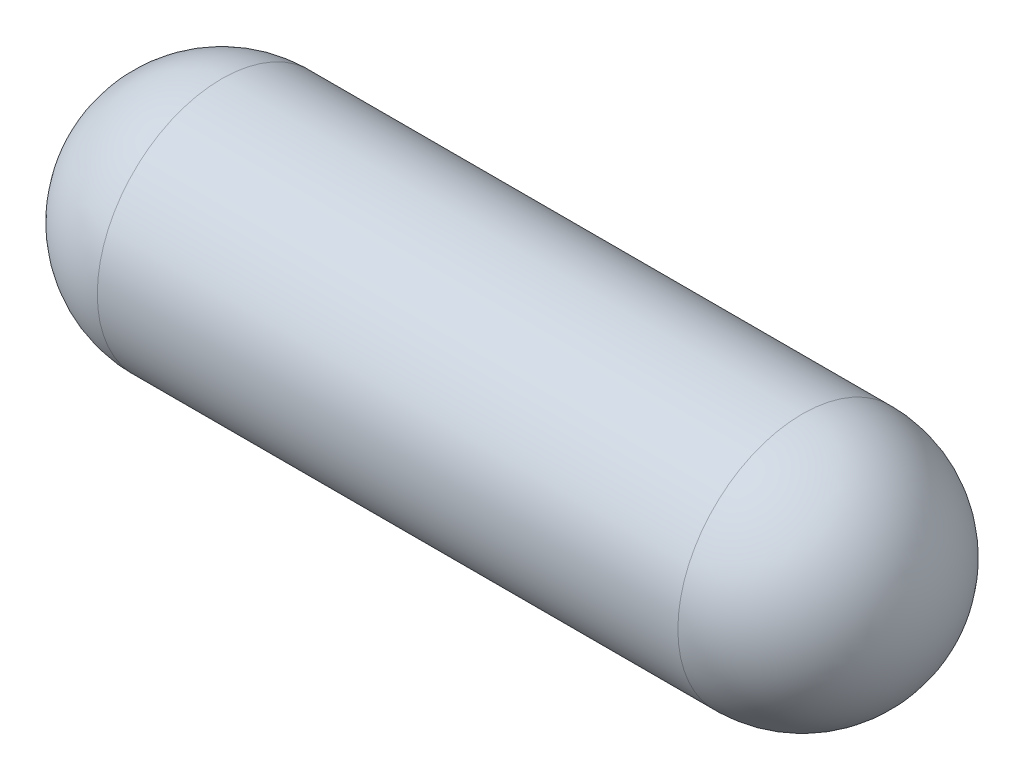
ISO-10303-21;
HEADER;
FILE_DESCRIPTION(('STEP AP214'),'2;1');
FILE_NAME('part.step','',(''),(''),'','','');
FILE_SCHEMA(('AUTOMOTIVE_DESIGN { 1 0 10303 214 1 1 1 1 }'));
ENDSEC;
DATA;
#1=APPLICATION_CONTEXT('core data for automotive mechanical design processes');
#2=APPLICATION_PROTOCOL_DEFINITION('international standard','automotive_design',2000,#1);
#3=PRODUCT_CONTEXT('',#1,'mechanical');
#4=PRODUCT('Part','Part','',(#3));
#5=PRODUCT_RELATED_PRODUCT_CATEGORY('part','',(#4));
#6=PRODUCT_DEFINITION_FORMATION('','',#4);
#7=PRODUCT_DEFINITION_CONTEXT('part definition',#1,'design');
#8=PRODUCT_DEFINITION('design','',#6,#7);
#9=PRODUCT_DEFINITION_SHAPE('','',#8);
#10=(LENGTH_UNIT() NAMED_UNIT(*) SI_UNIT(.MILLI.,.METRE.));
#11=(NAMED_UNIT(*) PLANE_ANGLE_UNIT() SI_UNIT($,.RADIAN.));
#12=(NAMED_UNIT(*) SI_UNIT($,.STERADIAN.) SOLID_ANGLE_UNIT());
#13=UNCERTAINTY_MEASURE_WITH_UNIT(LENGTH_MEASURE(1.E-05),#10,'distance_accuracy_value','');
#14=(GEOMETRIC_REPRESENTATION_CONTEXT(3) GLOBAL_UNCERTAINTY_ASSIGNED_CONTEXT((#13)) GLOBAL_UNIT_ASSIGNED_CONTEXT((#10,
#11,#12)) REPRESENTATION_CONTEXT('',''));
#15=CARTESIAN_POINT('',(0.,0.,0.));
#16=DIRECTION('',(0.,0.,1.));
#17=DIRECTION('',(1.,0.,0.));
#18=AXIS2_PLACEMENT_3D('',#15,#16,#17);
#19=CARTESIAN_POINT('',(-24.,115.58,-1.11022302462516E-13));
#20=DIRECTION('',(1.,0.,0.));
#21=DIRECTION('',(0.,1.,0.));
#22=AXIS2_PLACEMENT_3D('',#19,#20,#21);
#23=CYLINDRICAL_SURFACE('',#22,1.5);
#24=CARTESIAN_POINT('',(-17.,115.58,-1.11022302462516E-13));
#25=DIRECTION('',(1.,0.,0.));
#26=DIRECTION('',(0.,0.,1.));
#27=AXIS2_PLACEMENT_3D('',#24,#25,#26);
#28=CIRCLE('',#27,1.5);
#29=CARTESIAN_POINT('',(-17.,117.08,-1.11297838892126E-13));
#30=VERTEX_POINT('',#29);
#31=CARTESIAN_POINT('',(-17.,114.08,-1.10930456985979E-13));
#32=VERTEX_POINT('',#31);
#33=EDGE_CURVE('E10',#30,#32,#28,.T.);
#34=ORIENTED_EDGE('',*,*,#33,.F.);
#35=CARTESIAN_POINT('',(-17.,115.58,-1.11022302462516E-13));
#36=DIRECTION('',(-1.,0.,0.));
#37=DIRECTION('',(0.,0.,-1.));
#38=AXIS2_PLACEMENT_3D('',#35,#36,#37);
#39=CIRCLE('',#38,1.5);
#40=EDGE_CURVE('E23',#30,#32,#39,.T.);
#41=ORIENTED_EDGE('',*,*,#40,.T.);
#42=EDGE_LOOP('',(#34,#41));
#43=FACE_BOUND('',#42,.T.);
#44=CARTESIAN_POINT('',(-24.,115.58,-1.11022302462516E-13));
#45=DIRECTION('',(1.,0.,0.));
#46=DIRECTION('',(0.,0.,1.));
#47=AXIS2_PLACEMENT_3D('',#44,#45,#46);
#48=CIRCLE('',#47,1.5);
#49=CARTESIAN_POINT('',(-24.,117.08,-1.10746766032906E-13));
#50=VERTEX_POINT('',#49);
#51=CARTESIAN_POINT('',(-24.,114.08,-1.11114147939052E-13));
#52=VERTEX_POINT('',#51);
#53=EDGE_CURVE('E41',#50,#52,#48,.T.);
#54=ORIENTED_EDGE('',*,*,#53,.T.);
#55=CARTESIAN_POINT('',(-24.,115.58,-1.11022302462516E-13));
#56=DIRECTION('',(-1.,0.,0.));
#57=DIRECTION('',(0.,0.,-1.));
#58=AXIS2_PLACEMENT_3D('',#55,#56,#57);
#59=CIRCLE('',#58,1.5);
#60=EDGE_CURVE('E29',#50,#52,#59,.T.);
#61=ORIENTED_EDGE('',*,*,#60,.F.);
#62=EDGE_LOOP('',(#54,#61));
#63=FACE_BOUND('',#62,.T.);
#64=ADVANCED_FACE('F15',(#43,#63),#23,.T.);
#65=CARTESIAN_POINT('',(-17.,115.58,-1.11022302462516E-13));
#66=DIRECTION('',(0.,-1.,0.));
#67=DIRECTION('',(0.,0.,-1.));
#68=AXIS2_PLACEMENT_3D('',#65,#66,#67);
#69=SPHERICAL_SURFACE('',#68,1.5);
#70=CARTESIAN_POINT('',(-17.,115.58,-1.11022302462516E-13));
#71=DIRECTION('',(1.,0.,0.));
#72=DIRECTION('',(0.,0.,1.));
#73=AXIS2_PLACEMENT_3D('',#70,#71,#72);
#74=SPHERICAL_SURFACE('',#73,1.5);
#75=ORIENTED_EDGE('',*,*,#33,.T.);
#76=ORIENTED_EDGE('',*,*,#40,.F.);
#77=EDGE_LOOP('',(#75,#76));
#78=FACE_BOUND('',#77,.T.);
#79=ADVANCED_FACE('F79',(#78),#74,.T.);
#80=CARTESIAN_POINT('',(-24.,115.58,-1.11022302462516E-13));
#81=DIRECTION('',(0.,-1.,0.));
#82=DIRECTION('',(0.,0.,1.));
#83=AXIS2_PLACEMENT_3D('',#80,#81,#82);
#84=SPHERICAL_SURFACE('',#83,1.5);
#85=CARTESIAN_POINT('',(-24.,115.58,-1.11022302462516E-13));
#86=DIRECTION('',(-1.,0.,0.));
#87=DIRECTION('',(0.,0.,-1.));
#88=AXIS2_PLACEMENT_3D('',#85,#86,#87);
#89=SPHERICAL_SURFACE('',#88,1.5);
#90=ORIENTED_EDGE('',*,*,#60,.T.);
#91=ORIENTED_EDGE('',*,*,#53,.F.);
#92=EDGE_LOOP('',(#90,#91));
#93=FACE_BOUND('',#92,.T.);
#94=ADVANCED_FACE('F40',(#93),#89,.T.);
#95=CLOSED_SHELL('',(#64,#79,#94));
#96=MANIFOLD_SOLID_BREP('B1',#95);
#97=ADVANCED_BREP_SHAPE_REPRESENTATION('',(#18,#96),#14);
#98=SHAPE_DEFINITION_REPRESENTATION(#9,#97);
ENDSEC;
END-ISO-10303-21;
